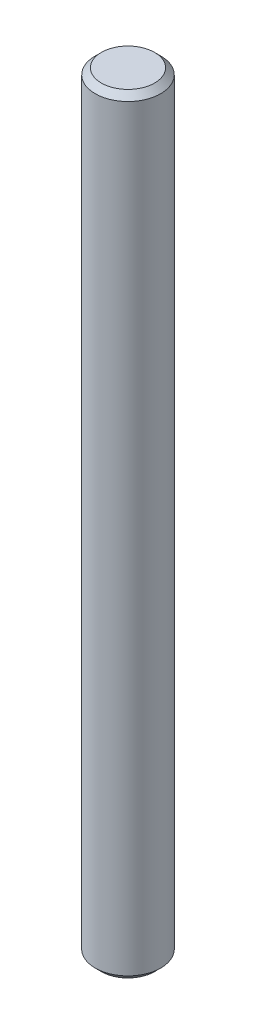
from build123d import *

# Parameters (mm, degrees)
SKETCH1_R      = 4
EXTRUDE1_DEPTH = 94
CHAMFER1_SIZE  = 0.75


with BuildPart() as part:
    # Sketch1 → Extrude1 (new body)
    with BuildSketch(Plane(origin=(0, 0, 0), x_dir=(1, 0, 0), z_dir=(0, 1, 0))):
        with Locations(Location((0, 0, 0), (0, 0, 270))):
            Circle(SKETCH1_R)
    extrude(amount=EXTRUDE1_DEPTH)

    # Chamfer1
    chamfer1_edges = [part.edges().sort_by_distance(p)[0] for p in [
        (0, 0, -4),
        (0, 94, -4),
    ]]
    chamfer(chamfer1_edges, length=CHAMFER1_SIZE)


solid = part.part
